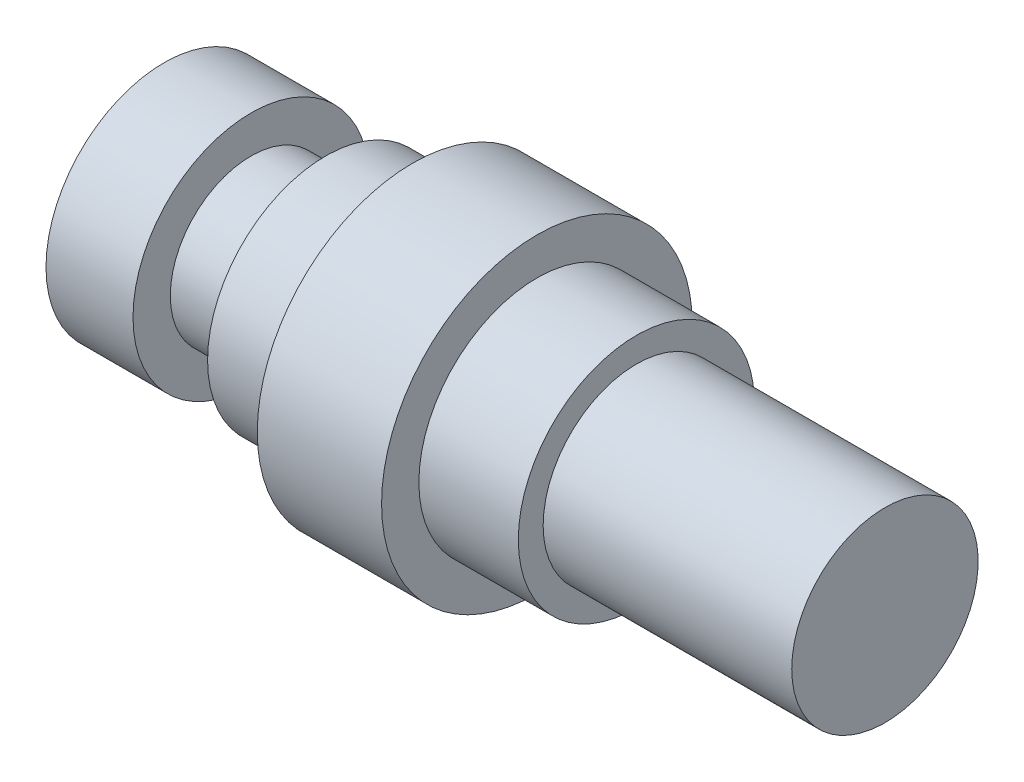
from build123d import *

# Parameters (mm, degrees)
SCALE1_SCALE = 0.75


with BuildPart() as part:
    # Sketch1 → Revolve1 (revolve)
    with BuildSketch(Plane.XY, mode=Mode.PRIVATE) as revolve1_sk:
        Polygon((-70.682926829, 0), (-70.682926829, 9.5), (-63.682926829, 9.5), (-63.682926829, 6.5), (-57.682926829, 6.5), (-57.682926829, 9.5), (-50.682926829, 9.5), (-50.682926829, 12.5), (-40.682926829, 12.5), (-40.682926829, 9.5), (-32.682926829, 9.5), (-32.682926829, 7.5), (-12.682926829, 7.5), (-12.682926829, 0), align=None)
    revolve(revolve1_sk.sketch.rotate(Axis((-78.024390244, 0, 0), (1, 0, 0)), 90), axis=Axis((-78.024390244, 0, 0), (1, 0, 0)))


with BuildPart() as part_1:
    # Scale1: scaled about (-43.730628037, 0, 0)
    add(part.part.scale(SCALE1_SCALE).moved(Location((-10.932657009, 0, 0))))


solid = part_1.part
